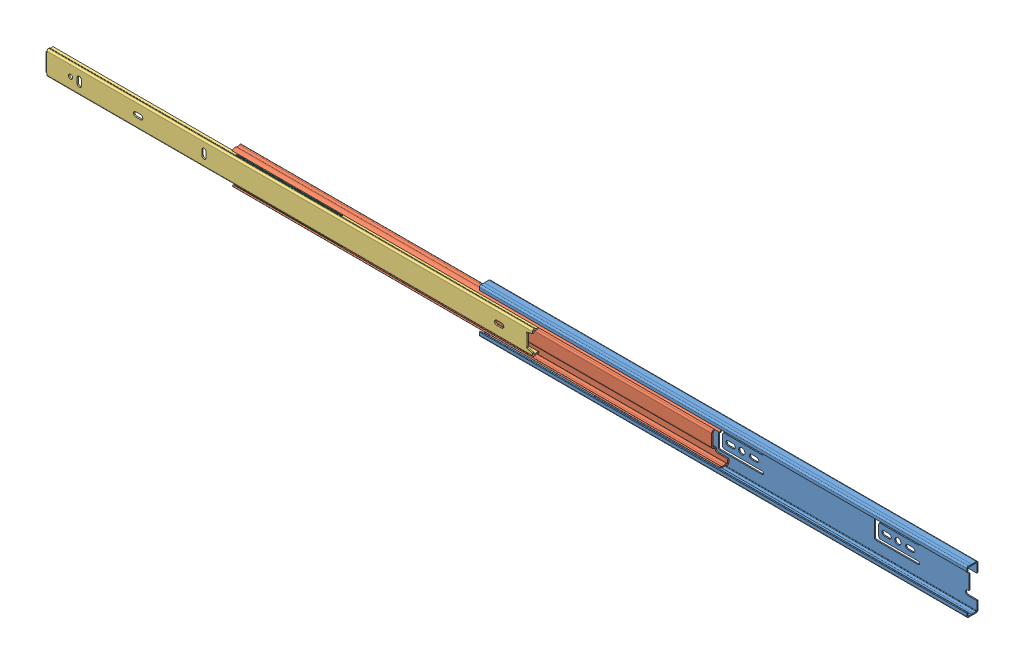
SolidWorks assembly Drawer Slide.sldasm, configuration Drawer Slide-Sliding (file format 7000). Lengths in mm.
Overall size (944.34 45.64 12.7).
7 component instances, 7 part files, 30 mates.
Components (placement in the parent):
- Base-1: Base.sldprt [Base] at origin
- Middle-1: Middle.sldprt [Middle] at (0.4232 0.0312 0)
- Top-1: Top.sldprt [Top] at (63.7898 -0.0811 0)
- Bearing BM-T-1: Bearing BM-T.sldprt [Bearing BM-T] at (1.1629 0.0312 0)
- Bearing BM-B-1: Bearing BM-B.sldprt [Bearing BM-B] at (1.1629 0 0.0312)
- Bearing MT-T-1: Bearing MT-T.sldprt [Bearing MT-T] at (-27.3898 0.0312 0)
- Bearing MT-B-1: Bearing MT-B.sldprt [Bearing MT-B] at (-27.3898 0.0312 0)
Mates (geometry in assembly coordinates):
- Parallel13: parallel aligned: plane of assembly through (0 0 0) normal (0 1 0); plane of Bearing BM-T-1 through (-242.5501 19.5866 3.9624) normal (0 1 0)
- Parallel14: parallel aligned: plane of assembly through (0 0 0) normal (0 1 0); plane of Bearing MT-T-1 through (-499.7028 14.1573 0.2286) normal (0 1 0)
- Parallel15: parallel aligned: plane of assembly through (0 0 0) normal (0 1 0); plane of Bearing BM-B-1 through (-242.5501 -18.7934 3.9936) normal (0 1 0)
- Parallel16: parallel aligned: plane of assembly through (0 0 0) normal (0 1 0); plane of Bearing MT-B-1 through (-499.7028 -13.3329 0.2286) normal (0 1 0)
- Parallel17: parallel aligned: plane of Base-1 through (250.063 0 -5.6388) normal (0 0 -1); plane of Bearing BM-B-1 through (1.1629 0 -3.6264) normal (0 0 -1)
- Parallel18: parallel aligned: plane of Base-1 through (250.063 0 -5.6388) normal (0 0 -1); plane of Middle-1 through (-503.6398 -16.3454 -3.5306) normal (0 0 -1)
- Parallel19: parallel aligned: plane of Base-1 through (250.063 0 -5.6388) normal (0 0 -1); plane of Bearing MT-B-1 through (-27.3898 0.0312 0.2286) normal (0 0 -1)
- Parallel20: parallel aligned: plane of Base-1 through (250.063 0 -5.6388) normal (0 0 -1); plane of Bearing MT-T-1 through (-27.3898 0.0312 0.2286) normal (0 0 -1)
- Parallel21: parallel aligned: plane of Base-1 through (250.063 0 -5.6388) normal (0 0 -1); plane of Bearing BM-T-1 through (1.1629 0.0312 -3.6576) normal (0 0 -1)
- Parallel22: parallel aligned: plane of Base-1 through (250.063 0 -5.6388) normal (0 0 -1); plane of Top-1 through (-199.8621 6.5217 5.6642) normal (0 0 -1)
- Parallel24: parallel anti-aligned: plane of Base-1 through (250.063 0 -5.6388) normal (0 0 -1); plane of assembly through (0 0 0) normal (0 0 1)
- Tangent9: tangent: cylinder of Base-1 through (250.063 19.1744 0.1524) axis (-1 0 0) radius 2.54; face of Bearing BM-T-1
- Tangent10: tangent: cylinder of Middle-1 through (-503.6398 19.2056 0.1524) axis (1 0 0) radius 2.5088; face of Bearing BM-T-1
- Tangent11: tangent: cylinder of Middle-1 through (-503.6398 13.7763 2.7686) axis (1 0 0) radius 2.2987; face of Bearing MT-T-1
- Tangent12: tangent: cylinder of Top-1 through (-194.1472 13.664 2.7686) axis (-1 0 0) radius 2.411; face of Bearing MT-T-1
- Tangent15: tangent: cylinder of Base-1 through (250.063 -19.1744 0.1524) axis (-1 0 0) radius 2.54; face of Bearing BM-B-1
- Parallel25: parallel aligned: plane of Top-1 through (-194.1472 10.5424 5.5372) normal (1 0 0); plane of assembly through (0 0 0) normal (1 0 0)
- Coincident21: coincident aligned: plane of Bearing MT-T-1 through (-499.7028 0.0312 0) normal (-1 0 0); plane of Bearing MT-B-1 through (-499.7028 0.0312 0) normal (-1 0 0)
- Tangent17: tangent: cylinder of Top-1 through (-194.1472 -13.8262 2.7686) axis (-1 0 0) radius 2.411; face of Bearing MT-B-1
- Parallel26: parallel aligned: plane of Base-1 through (250.063 19.1744 0.1524) normal (1 0 0); plane of Middle-1 through (-3.5138 19.2056 0.1524) normal (1 0 0)
- LimitDistance1: limit distance = 253.5768 mm aligned: plane of Middle-1 through (-3.5138 19.2056 0.1524) normal (1 0 0); plane of Base-1 through (250.063 19.1744 0.1524) normal (1 0 0)
- LimitDistance2: limit distance = 190.6333 mm aligned: plane of Middle-1 through (-3.5138 19.2056 0.1524) normal (1 0 0); plane of Top-1 through (-194.1472 10.5424 5.5372) normal (1 0 0)
- LimitDistance3: limit distance = 384.6631 mm aligned: plane of Bearing BM-B-1 through (-134.6001 0 0.0312) normal (1 0 0); plane of Base-1 through (250.063 -19.1744 0.1524) normal (1 0 0)
- LimitDistance6: limit distance = 3.937 mm aligned: plane of Bearing MT-T-1 through (-499.7028 0.0312 0) normal (-1 0 0); plane of Middle-1 through (-503.6398 19.2056 0.1524) normal (-1 0 0)
- Distance1: distance = 3.937 mm aligned: plane of Middle-1 through (246.126 19.1864 0.1812) normal (1 0 0); plane of Base-1 through (250.063 19.1744 0.1524) normal (1 0 0)
- Distance2: distance = 3.937 mm aligned: plane of Middle-1 through (246.126 19.1864 0.1812) normal (1 0 0); plane of Top-1 through (242.189 10.5232 5.566) normal (1 0 0)
- Distance4: distance = 6.32 mm aligned: plane of Base-1 through (250.063 19.1744 0.1524) normal (1 0 0); plane of Bearing BM-T-1 through (243.743 0.0121 0.0288) normal (1 0 0)
- Distance5: distance = 21.463 mm aligned: plane of Bearing BM-T-1 through (243.743 0.0121 0.0288) normal (1 0 0); plane of Bearing MT-T-1 through (222.28 0.0121 0.0288) normal (1 0 0)
- Coincident22: coincident aligned: plane of Bearing BM-T-1 through (243.743 0.0121 0.0288) normal (1 0 0); plane of Bearing BM-B-1 through (243.743 0 0.0312) normal (1 0 0)
- Coincident23: coincident aligned: plane of Bearing BM-T-1 through (-134.6001 0.0312 0) normal (1 0 0); plane of Bearing BM-B-1 through (-134.6001 0 0.0312) normal (1 0 0)
